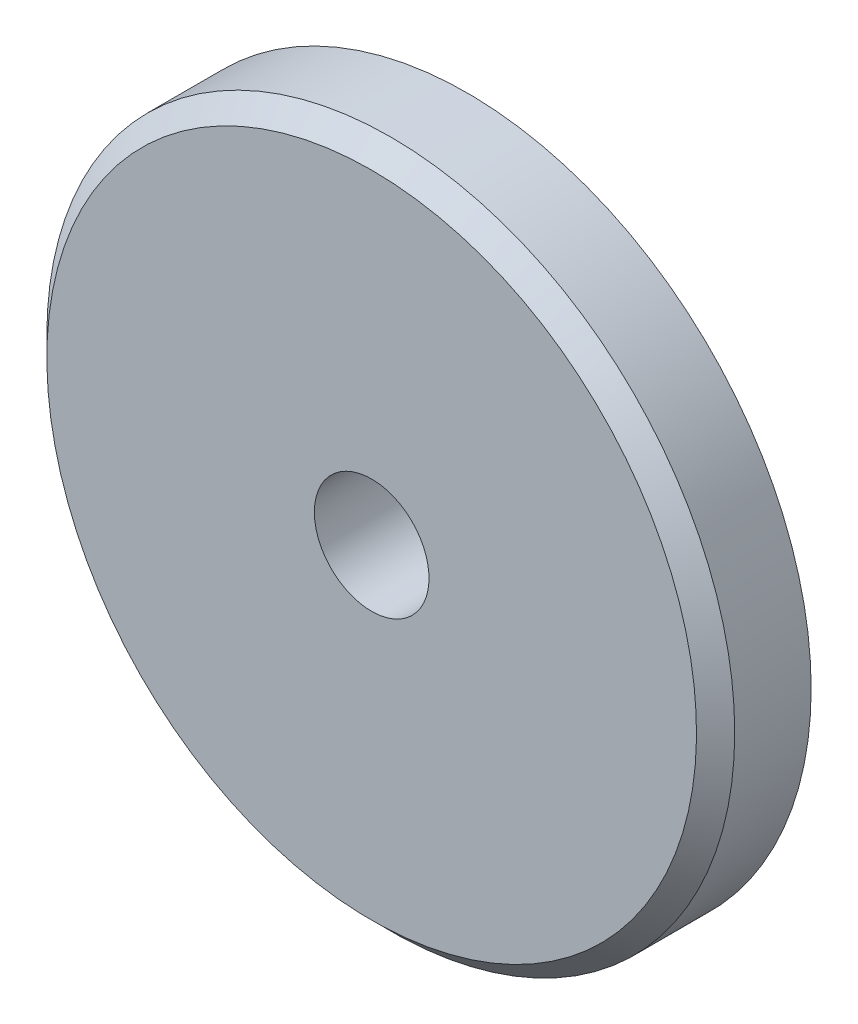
ISO-10303-21;
HEADER;
FILE_DESCRIPTION(('STEP AP214'),'2;1');
FILE_NAME('part.step','',(''),(''),'','','');
FILE_SCHEMA(('AUTOMOTIVE_DESIGN { 1 0 10303 214 1 1 1 1 }'));
ENDSEC;
DATA;
#1=APPLICATION_CONTEXT('core data for automotive mechanical design processes');
#2=APPLICATION_PROTOCOL_DEFINITION('international standard','automotive_design',2000,#1);
#3=PRODUCT_CONTEXT('',#1,'mechanical');
#4=PRODUCT('Part','Part','',(#3));
#5=PRODUCT_RELATED_PRODUCT_CATEGORY('part','',(#4));
#6=PRODUCT_DEFINITION_FORMATION('','',#4);
#7=PRODUCT_DEFINITION_CONTEXT('part definition',#1,'design');
#8=PRODUCT_DEFINITION('design','',#6,#7);
#9=PRODUCT_DEFINITION_SHAPE('','',#8);
#10=(LENGTH_UNIT() NAMED_UNIT(*) SI_UNIT(.MILLI.,.METRE.));
#11=(NAMED_UNIT(*) PLANE_ANGLE_UNIT() SI_UNIT($,.RADIAN.));
#12=(NAMED_UNIT(*) SI_UNIT($,.STERADIAN.) SOLID_ANGLE_UNIT());
#13=UNCERTAINTY_MEASURE_WITH_UNIT(LENGTH_MEASURE(1.E-05),#10,'distance_accuracy_value','');
#14=(GEOMETRIC_REPRESENTATION_CONTEXT(3) GLOBAL_UNCERTAINTY_ASSIGNED_CONTEXT((#13)) GLOBAL_UNIT_ASSIGNED_CONTEXT((#10,
#11,#12)) REPRESENTATION_CONTEXT('',''));
#15=CARTESIAN_POINT('',(0.,0.,0.));
#16=DIRECTION('',(0.,0.,1.));
#17=DIRECTION('',(1.,0.,0.));
#18=AXIS2_PLACEMENT_3D('',#15,#16,#17);
#19=CARTESIAN_POINT('',(0.,0.,5.));
#20=DIRECTION('',(0.,0.,-1.));
#21=DIRECTION('',(-1.,0.,0.));
#22=AXIS2_PLACEMENT_3D('',#19,#20,#21);
#23=PLANE('',#22);
#24=CARTESIAN_POINT('',(0.,0.,5.));
#25=DIRECTION('',(0.,0.,1.));
#26=DIRECTION('',(1.,0.,0.));
#27=AXIS2_PLACEMENT_3D('',#24,#25,#26);
#28=CIRCLE('',#27,15.);
#29=CARTESIAN_POINT('',(15.,0.,5.));
#30=VERTEX_POINT('',#29);
#31=EDGE_CURVE('E18',#30,#30,#28,.F.);
#32=ORIENTED_EDGE('',*,*,#31,.F.);
#33=EDGE_LOOP('',(#32));
#34=FACE_BOUND('',#33,.T.);
#35=CARTESIAN_POINT('',(0.,0.,5.));
#36=DIRECTION('',(0.,0.,1.));
#37=DIRECTION('',(1.,0.,0.));
#38=AXIS2_PLACEMENT_3D('',#35,#36,#37);
#39=CIRCLE('',#38,36.);
#40=CARTESIAN_POINT('',(36.,0.,5.));
#41=VERTEX_POINT('',#40);
#42=EDGE_CURVE('E36',#41,#41,#39,.T.);
#43=ORIENTED_EDGE('',*,*,#42,.F.);
#44=EDGE_LOOP('',(#43));
#45=FACE_BOUND('',#44,.T.);
#46=ADVANCED_FACE('F14',(#34,#45),#23,.T.);
#47=CARTESIAN_POINT('',(0.,0.,0.));
#48=DIRECTION('',(0.,0.,1.));
#49=DIRECTION('',(1.,0.,0.));
#50=AXIS2_PLACEMENT_3D('',#47,#48,#49);
#51=CYLINDRICAL_SURFACE('',#50,15.);
#52=ORIENTED_EDGE('',*,*,#31,.T.);
#53=EDGE_LOOP('',(#52));
#54=FACE_BOUND('',#53,.T.);
#55=CARTESIAN_POINT('',(0.,0.,0.));
#56=DIRECTION('',(0.,0.,1.));
#57=DIRECTION('',(1.,0.,0.));
#58=AXIS2_PLACEMENT_3D('',#55,#56,#57);
#59=CIRCLE('',#58,15.);
#60=CARTESIAN_POINT('',(15.,0.,0.));
#61=VERTEX_POINT('',#60);
#62=EDGE_CURVE('E34',#61,#61,#59,.F.);
#63=ORIENTED_EDGE('',*,*,#62,.F.);
#64=EDGE_LOOP('',(#63));
#65=FACE_BOUND('',#64,.T.);
#66=ADVANCED_FACE('F43',(#54,#65),#51,.T.);
#67=CARTESIAN_POINT('',(0.,0.,5.));
#68=DIRECTION('',(0.,0.,1.));
#69=DIRECTION('',(1.,0.,0.));
#70=AXIS2_PLACEMENT_3D('',#67,#68,#69);
#71=CYLINDRICAL_SURFACE('',#70,36.);
#72=ORIENTED_EDGE('',*,*,#42,.T.);
#73=EDGE_LOOP('',(#72));
#74=FACE_BOUND('',#73,.T.);
#75=CARTESIAN_POINT('',(0.,0.,12.9999999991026));
#76=DIRECTION('',(0.,0.,-1.));
#77=DIRECTION('',(-1.,0.,0.));
#78=AXIS2_PLACEMENT_3D('',#75,#76,#77);
#79=CIRCLE('',#78,35.9999999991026);
#80=CARTESIAN_POINT('',(-35.9999999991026,0.,12.9999999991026));
#81=VERTEX_POINT('',#80);
#82=EDGE_CURVE('E30',#81,#81,#79,.F.);
#83=ORIENTED_EDGE('',*,*,#82,.F.);
#84=EDGE_LOOP('',(#83));
#85=FACE_BOUND('',#84,.T.);
#86=ADVANCED_FACE('F52',(#74,#85),#71,.T.);
#87=CARTESIAN_POINT('',(0.,0.,0.));
#88=DIRECTION('',(0.,0.,-1.));
#89=DIRECTION('',(-1.,0.,0.));
#90=AXIS2_PLACEMENT_3D('',#87,#88,#89);
#91=PLANE('',#90);
#92=CARTESIAN_POINT('',(0.,0.,0.));
#93=DIRECTION('',(0.,0.,-1.));
#94=DIRECTION('',(-1.,0.,0.));
#95=AXIS2_PLACEMENT_3D('',#92,#93,#94);
#96=CIRCLE('',#95,6.);
#97=CARTESIAN_POINT('',(-6.,0.,0.));
#98=VERTEX_POINT('',#97);
#99=EDGE_CURVE('E27',#98,#98,#96,.F.);
#100=ORIENTED_EDGE('',*,*,#99,.T.);
#101=EDGE_LOOP('',(#100));
#102=FACE_BOUND('',#101,.T.);
#103=ORIENTED_EDGE('',*,*,#62,.T.);
#104=EDGE_LOOP('',(#103));
#105=FACE_BOUND('',#104,.T.);
#106=ADVANCED_FACE('F65',(#102,#105),#91,.T.);
#107=CARTESIAN_POINT('',(0.,0.,12.9999999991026));
#108=DIRECTION('',(0.,0.,-1.));
#109=DIRECTION('',(0.,1.,0.));
#110=AXIS2_PLACEMENT_3D('',#107,#108,#109);
#111=CONICAL_SURFACE('',#110,35.9999999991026,0.7853981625);
#112=ORIENTED_EDGE('',*,*,#82,.T.);
#113=EDGE_LOOP('',(#112));
#114=FACE_BOUND('',#113,.T.);
#115=CARTESIAN_POINT('',(0.,0.,15.0000000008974));
#116=DIRECTION('',(0.,0.,-1.));
#117=DIRECTION('',(0.,1.,0.));
#118=AXIS2_PLACEMENT_3D('',#115,#116,#117);
#119=CIRCLE('',#118,34.0000000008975);
#120=CARTESIAN_POINT('',(0.,34.0000000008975,15.0000000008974));
#121=VERTEX_POINT('',#120);
#122=EDGE_CURVE('E22',#121,#121,#119,.T.);
#123=ORIENTED_EDGE('',*,*,#122,.T.);
#124=EDGE_LOOP('',(#123));
#125=FACE_BOUND('',#124,.T.);
#126=ADVANCED_FACE('F59',(#114,#125),#111,.T.);
#127=CARTESIAN_POINT('',(0.,0.,15.));
#128=DIRECTION('',(0.,0.,-1.));
#129=DIRECTION('',(-1.,0.,0.));
#130=AXIS2_PLACEMENT_3D('',#127,#128,#129);
#131=CYLINDRICAL_SURFACE('',#130,6.);
#132=ORIENTED_EDGE('',*,*,#99,.F.);
#133=EDGE_LOOP('',(#132));
#134=FACE_BOUND('',#133,.T.);
#135=CARTESIAN_POINT('',(0.,0.,15.));
#136=DIRECTION('',(0.,0.,-1.));
#137=DIRECTION('',(-1.,0.,0.));
#138=AXIS2_PLACEMENT_3D('',#135,#136,#137);
#139=CIRCLE('',#138,6.);
#140=CARTESIAN_POINT('',(-6.,0.,15.));
#141=VERTEX_POINT('',#140);
#142=EDGE_CURVE('E9',#141,#141,#139,.F.);
#143=ORIENTED_EDGE('',*,*,#142,.T.);
#144=EDGE_LOOP('',(#143));
#145=FACE_BOUND('',#144,.T.);
#146=ADVANCED_FACE('F16',(#134,#145),#131,.F.);
#147=CARTESIAN_POINT('',(0.,0.,15.));
#148=DIRECTION('',(0.,0.,-1.));
#149=DIRECTION('',(-1.,0.,0.));
#150=AXIS2_PLACEMENT_3D('',#147,#148,#149);
#151=PLANE('',#150);
#152=ORIENTED_EDGE('',*,*,#142,.F.);
#153=EDGE_LOOP('',(#152));
#154=FACE_BOUND('',#153,.T.);
#155=ORIENTED_EDGE('',*,*,#122,.F.);
#156=EDGE_LOOP('',(#155));
#157=FACE_BOUND('',#156,.T.);
#158=ADVANCED_FACE('F54',(#154,#157),#151,.F.);
#159=CLOSED_SHELL('',(#46,#66,#86,#106,#126,#146,#158));
#160=MANIFOLD_SOLID_BREP('B1',#159);
#161=ADVANCED_BREP_SHAPE_REPRESENTATION('',(#18,#160),#14);
#162=SHAPE_DEFINITION_REPRESENTATION(#9,#161);
ENDSEC;
END-ISO-10303-21;
